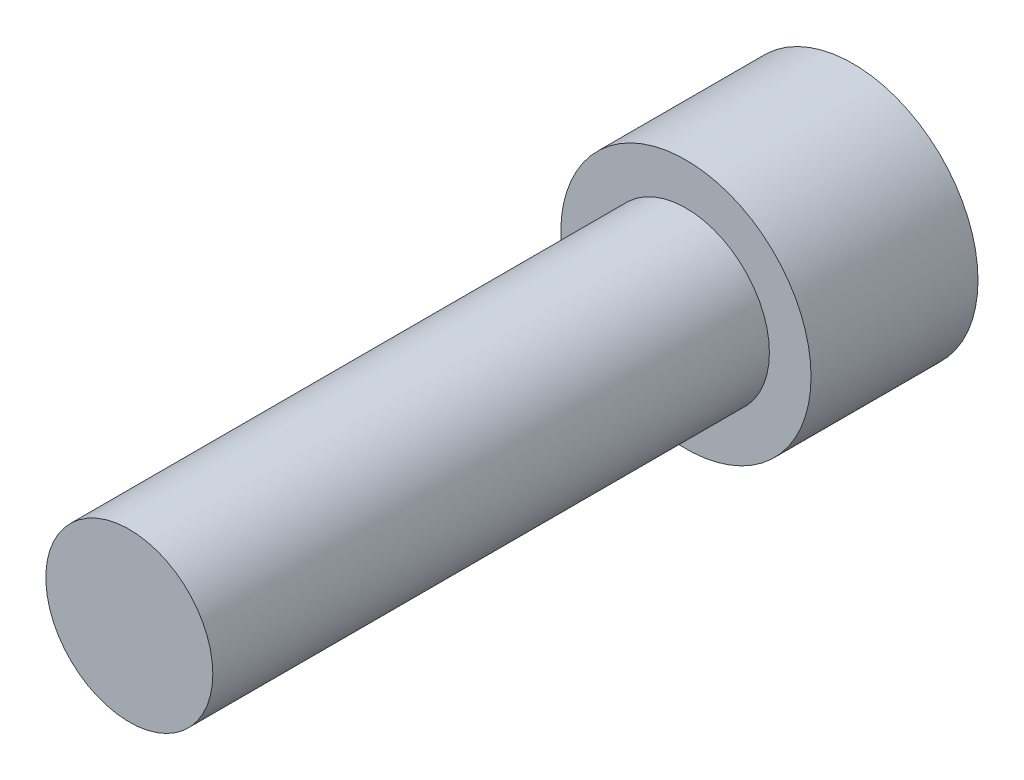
from build123d import *

# Parameters (mm, degrees)
HEX_2_DEPTH = 5.842


with BuildPart() as part:
    # Sketch6 → Revolve1 (revolve)
    with BuildSketch(Plane(origin=(0, 0, 0), x_dir=(0, 0, -1), z_dir=(1, 0, 0)), mode=Mode.PRIVATE) as revolve1_sk:
        Polygon((-31.75, 0), (-31.75, -4.7625), (0, -4.7625), (0, -7.1374), (9.525, -7.1374), (9.525, 0), align=None)
    revolve(revolve1_sk.sketch.rotate(Axis((0, 0, 31.75), (0, 0, -1)), 270), axis=Axis((0, 0, 31.75), (0, 0, -1)))

    # Sketch7 → HEX 2 (cut)
    with BuildSketch(Plane(origin=(0, 0, -9.525), x_dir=(-1, 0, 0), z_dir=(0, 0, -1))):
        Polygon((-3.9624, 2.287692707), (-3.9624, -2.287692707), (0, -4.575385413), (3.9624, -2.287692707), (3.9624, 2.287692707), (0, 4.575385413), align=None)
    extrude(amount=-HEX_2_DEPTH, mode=Mode.SUBTRACT)


solid = part.part
